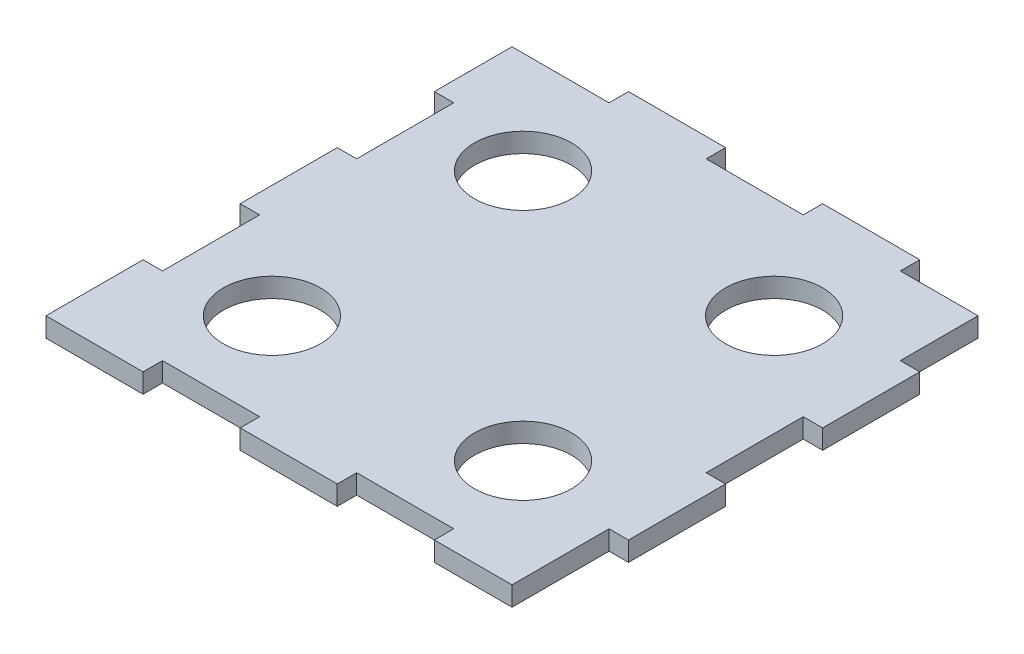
ISO-10303-21;
HEADER;
FILE_DESCRIPTION(('STEP AP214'),'2;1');
FILE_NAME('part.step','',(''),(''),'','','');
FILE_SCHEMA(('AUTOMOTIVE_DESIGN { 1 0 10303 214 1 1 1 1 }'));
ENDSEC;
DATA;
#1=APPLICATION_CONTEXT('core data for automotive mechanical design processes');
#2=APPLICATION_PROTOCOL_DEFINITION('international standard','automotive_design',2000,#1);
#3=PRODUCT_CONTEXT('',#1,'mechanical');
#4=PRODUCT('Part','Part','',(#3));
#5=PRODUCT_RELATED_PRODUCT_CATEGORY('part','',(#4));
#6=PRODUCT_DEFINITION_FORMATION('','',#4);
#7=PRODUCT_DEFINITION_CONTEXT('part definition',#1,'design');
#8=PRODUCT_DEFINITION('design','',#6,#7);
#9=PRODUCT_DEFINITION_SHAPE('','',#8);
#10=(LENGTH_UNIT() NAMED_UNIT(*) SI_UNIT(.MILLI.,.METRE.));
#11=(NAMED_UNIT(*) PLANE_ANGLE_UNIT() SI_UNIT($,.RADIAN.));
#12=(NAMED_UNIT(*) SI_UNIT($,.STERADIAN.) SOLID_ANGLE_UNIT());
#13=UNCERTAINTY_MEASURE_WITH_UNIT(LENGTH_MEASURE(1.E-05),#10,'distance_accuracy_value','');
#14=(GEOMETRIC_REPRESENTATION_CONTEXT(3) GLOBAL_UNCERTAINTY_ASSIGNED_CONTEXT((#13)) GLOBAL_UNIT_ASSIGNED_CONTEXT((#10,
#11,#12)) REPRESENTATION_CONTEXT('',''));
#15=CARTESIAN_POINT('',(0.,0.,0.));
#16=DIRECTION('',(0.,0.,1.));
#17=DIRECTION('',(1.,0.,0.));
#18=AXIS2_PLACEMENT_3D('',#15,#16,#17);
#19=CARTESIAN_POINT('',(0.,4.,0.));
#20=DIRECTION('',(0.,1.,0.));
#21=DIRECTION('',(0.,0.,1.));
#22=AXIS2_PLACEMENT_3D('',#19,#20,#21);
#23=PLANE('',#22);
#24=CARTESIAN_POINT('',(-26.7320869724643,4.,26.7320869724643));
#25=DIRECTION('',(0.,1.,0.));
#26=DIRECTION('',(0.,0.,1.));
#27=AXIS2_PLACEMENT_3D('',#24,#25,#26);
#28=CIRCLE('',#27,10.);
#29=CARTESIAN_POINT('',(-26.7320869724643,4.,36.7320869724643));
#30=VERTEX_POINT('',#29);
#31=EDGE_CURVE('E603',#30,#30,#28,.T.);
#32=ORIENTED_EDGE('',*,*,#31,.F.);
#33=EDGE_LOOP('',(#32));
#34=FACE_BOUND('',#33,.T.);
#35=CARTESIAN_POINT('',(25.,4.,-25.));
#36=DIRECTION('',(0.,1.,0.));
#37=DIRECTION('',(0.,0.,1.));
#38=AXIS2_PLACEMENT_3D('',#35,#36,#37);
#39=CIRCLE('',#38,10.);
#40=CARTESIAN_POINT('',(25.,4.,-15.));
#41=VERTEX_POINT('',#40);
#42=EDGE_CURVE('E302',#41,#41,#39,.T.);
#43=ORIENTED_EDGE('',*,*,#42,.F.);
#44=EDGE_LOOP('',(#43));
#45=FACE_BOUND('',#44,.T.);
#46=DIRECTION('',(0.,0.,-1.));
#47=VECTOR('',#46,1.);
#48=CARTESIAN_POINT('',(46.,4.,30.));
#49=LINE('',#48,#47);
#50=CARTESIAN_POINT('',(46.,4.,50.));
#51=VERTEX_POINT('',#50);
#52=CARTESIAN_POINT('',(46.,4.,30.));
#53=VERTEX_POINT('',#52);
#54=EDGE_CURVE('E369',#51,#53,#49,.T.);
#55=ORIENTED_EDGE('',*,*,#54,.T.);
#56=DIRECTION('',(1.,0.,0.));
#57=VECTOR('',#56,1.);
#58=CARTESIAN_POINT('',(50.,4.,30.));
#59=LINE('',#58,#57);
#60=CARTESIAN_POINT('',(50.,4.,30.));
#61=VERTEX_POINT('',#60);
#62=EDGE_CURVE('E177',#53,#61,#59,.T.);
#63=ORIENTED_EDGE('',*,*,#62,.T.);
#64=DIRECTION('',(0.,0.,-1.));
#65=VECTOR('',#64,1.);
#66=CARTESIAN_POINT('',(50.,4.,9.99999999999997));
#67=LINE('',#66,#65);
#68=CARTESIAN_POINT('',(50.,4.,9.99999999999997));
#69=VERTEX_POINT('',#68);
#70=EDGE_CURVE('E468',#61,#69,#67,.T.);
#71=ORIENTED_EDGE('',*,*,#70,.T.);
#72=DIRECTION('',(-1.,0.,0.));
#73=VECTOR('',#72,1.);
#74=CARTESIAN_POINT('',(46.,4.,9.99999999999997));
#75=LINE('',#74,#73);
#76=CARTESIAN_POINT('',(46.,4.,9.99999999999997));
#77=VERTEX_POINT('',#76);
#78=EDGE_CURVE('E487',#69,#77,#75,.T.);
#79=ORIENTED_EDGE('',*,*,#78,.T.);
#80=DIRECTION('',(0.,0.,-1.));
#81=VECTOR('',#80,1.);
#82=CARTESIAN_POINT('',(46.,4.,-10.));
#83=LINE('',#82,#81);
#84=CARTESIAN_POINT('',(46.,4.,-10.));
#85=VERTEX_POINT('',#84);
#86=EDGE_CURVE('E484',#77,#85,#83,.T.);
#87=ORIENTED_EDGE('',*,*,#86,.T.);
#88=DIRECTION('',(1.,0.,0.));
#89=VECTOR('',#88,1.);
#90=CARTESIAN_POINT('',(50.,4.,-10.));
#91=LINE('',#90,#89);
#92=CARTESIAN_POINT('',(50.,4.,-10.));
#93=VERTEX_POINT('',#92);
#94=EDGE_CURVE('E486',#85,#93,#91,.T.);
#95=ORIENTED_EDGE('',*,*,#94,.T.);
#96=DIRECTION('',(0.,0.,-1.));
#97=VECTOR('',#96,1.);
#98=CARTESIAN_POINT('',(50.,4.,-30.));
#99=LINE('',#98,#97);
#100=CARTESIAN_POINT('',(50.,4.,-30.));
#101=VERTEX_POINT('',#100);
#102=EDGE_CURVE('E489',#93,#101,#99,.T.);
#103=ORIENTED_EDGE('',*,*,#102,.T.);
#104=DIRECTION('',(-1.,0.,0.));
#105=VECTOR('',#104,1.);
#106=CARTESIAN_POINT('',(46.,4.,-30.));
#107=LINE('',#106,#105);
#108=CARTESIAN_POINT('',(46.,4.,-30.));
#109=VERTEX_POINT('',#108);
#110=EDGE_CURVE('E495',#101,#109,#107,.T.);
#111=ORIENTED_EDGE('',*,*,#110,.T.);
#112=DIRECTION('',(0.,0.,-1.));
#113=VECTOR('',#112,1.);
#114=CARTESIAN_POINT('',(46.,4.,-46.));
#115=LINE('',#114,#113);
#116=CARTESIAN_POINT('',(46.,4.,-46.));
#117=VERTEX_POINT('',#116);
#118=EDGE_CURVE('E497',#109,#117,#115,.T.);
#119=ORIENTED_EDGE('',*,*,#118,.T.);
#120=DIRECTION('',(-1.,0.,0.));
#121=VECTOR('',#120,1.);
#122=CARTESIAN_POINT('',(30.,4.,-46.));
#123=LINE('',#122,#121);
#124=CARTESIAN_POINT('',(30.,4.,-46.));
#125=VERTEX_POINT('',#124);
#126=EDGE_CURVE('E499',#117,#125,#123,.T.);
#127=ORIENTED_EDGE('',*,*,#126,.T.);
#128=DIRECTION('',(0.,0.,-1.));
#129=VECTOR('',#128,1.);
#130=CARTESIAN_POINT('',(30.,4.,-50.));
#131=LINE('',#130,#129);
#132=CARTESIAN_POINT('',(30.,4.,-50.));
#133=VERTEX_POINT('',#132);
#134=EDGE_CURVE('E501',#125,#133,#131,.T.);
#135=ORIENTED_EDGE('',*,*,#134,.T.);
#136=DIRECTION('',(-1.,0.,0.));
#137=VECTOR('',#136,1.);
#138=CARTESIAN_POINT('',(9.99999999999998,4.,-50.));
#139=LINE('',#138,#137);
#140=CARTESIAN_POINT('',(9.99999999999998,4.,-50.));
#141=VERTEX_POINT('',#140);
#142=EDGE_CURVE('E503',#133,#141,#139,.T.);
#143=ORIENTED_EDGE('',*,*,#142,.T.);
#144=DIRECTION('',(0.,0.,1.));
#145=VECTOR('',#144,1.);
#146=CARTESIAN_POINT('',(9.99999999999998,4.,-46.0000000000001));
#147=LINE('',#146,#145);
#148=CARTESIAN_POINT('',(9.99999999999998,4.,-46.0000000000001));
#149=VERTEX_POINT('',#148);
#150=EDGE_CURVE('E505',#141,#149,#147,.T.);
#151=ORIENTED_EDGE('',*,*,#150,.T.);
#152=DIRECTION('',(-1.,0.,0.));
#153=VECTOR('',#152,1.);
#154=CARTESIAN_POINT('',(-10.,4.,-46.0000000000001));
#155=LINE('',#154,#153);
#156=CARTESIAN_POINT('',(-10.,4.,-46.0000000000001));
#157=VERTEX_POINT('',#156);
#158=EDGE_CURVE('E507',#149,#157,#155,.T.);
#159=ORIENTED_EDGE('',*,*,#158,.T.);
#160=DIRECTION('',(0.,0.,-1.));
#161=VECTOR('',#160,1.);
#162=CARTESIAN_POINT('',(-10.,4.,-46.0000000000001));
#163=LINE('',#162,#161);
#164=CARTESIAN_POINT('',(-10.,4.,-50.));
#165=VERTEX_POINT('',#164);
#166=EDGE_CURVE('E509',#157,#165,#163,.T.);
#167=ORIENTED_EDGE('',*,*,#166,.T.);
#168=DIRECTION('',(-1.,0.,0.));
#169=VECTOR('',#168,1.);
#170=CARTESIAN_POINT('',(-10.,4.,-50.));
#171=LINE('',#170,#169);
#172=CARTESIAN_POINT('',(-30.,4.,-50.));
#173=VERTEX_POINT('',#172);
#174=EDGE_CURVE('E511',#165,#173,#171,.T.);
#175=ORIENTED_EDGE('',*,*,#174,.T.);
#176=DIRECTION('',(0.,0.,1.));
#177=VECTOR('',#176,1.);
#178=CARTESIAN_POINT('',(-30.,4.,-50.));
#179=LINE('',#178,#177);
#180=CARTESIAN_POINT('',(-30.,4.,-46.));
#181=VERTEX_POINT('',#180);
#182=EDGE_CURVE('E513',#173,#181,#179,.T.);
#183=ORIENTED_EDGE('',*,*,#182,.T.);
#184=DIRECTION('',(-1.,0.,0.));
#185=VECTOR('',#184,1.);
#186=CARTESIAN_POINT('',(-50.,4.,-46.));
#187=LINE('',#186,#185);
#188=CARTESIAN_POINT('',(-50.,4.,-46.));
#189=VERTEX_POINT('',#188);
#190=EDGE_CURVE('E515',#181,#189,#187,.T.);
#191=ORIENTED_EDGE('',*,*,#190,.T.);
#192=DIRECTION('',(0.,0.,1.));
#193=VECTOR('',#192,1.);
#194=CARTESIAN_POINT('',(-50.,4.,-46.));
#195=LINE('',#194,#193);
#196=CARTESIAN_POINT('',(-50.,4.,-30.));
#197=VERTEX_POINT('',#196);
#198=EDGE_CURVE('E517',#189,#197,#195,.T.);
#199=ORIENTED_EDGE('',*,*,#198,.T.);
#200=DIRECTION('',(1.,0.,0.));
#201=VECTOR('',#200,1.);
#202=CARTESIAN_POINT('',(-50.,4.,-30.));
#203=LINE('',#202,#201);
#204=CARTESIAN_POINT('',(-46.,4.,-30.));
#205=VERTEX_POINT('',#204);
#206=EDGE_CURVE('E519',#197,#205,#203,.T.);
#207=ORIENTED_EDGE('',*,*,#206,.T.);
#208=DIRECTION('',(0.,0.,1.));
#209=VECTOR('',#208,1.);
#210=CARTESIAN_POINT('',(-46.,4.,-30.));
#211=LINE('',#210,#209);
#212=CARTESIAN_POINT('',(-46.,4.,-10.));
#213=VERTEX_POINT('',#212);
#214=EDGE_CURVE('E521',#205,#213,#211,.T.);
#215=ORIENTED_EDGE('',*,*,#214,.T.);
#216=DIRECTION('',(-1.,0.,0.));
#217=VECTOR('',#216,1.);
#218=CARTESIAN_POINT('',(-46.,4.,-10.));
#219=LINE('',#218,#217);
#220=CARTESIAN_POINT('',(-50.,4.,-10.));
#221=VERTEX_POINT('',#220);
#222=EDGE_CURVE('E523',#213,#221,#219,.T.);
#223=ORIENTED_EDGE('',*,*,#222,.T.);
#224=DIRECTION('',(0.,0.,1.));
#225=VECTOR('',#224,1.);
#226=CARTESIAN_POINT('',(-50.,4.,-10.));
#227=LINE('',#226,#225);
#228=CARTESIAN_POINT('',(-50.,4.,9.99999999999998));
#229=VERTEX_POINT('',#228);
#230=EDGE_CURVE('E525',#221,#229,#227,.T.);
#231=ORIENTED_EDGE('',*,*,#230,.T.);
#232=DIRECTION('',(1.,0.,0.));
#233=VECTOR('',#232,1.);
#234=CARTESIAN_POINT('',(-50.,4.,9.99999999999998));
#235=LINE('',#234,#233);
#236=CARTESIAN_POINT('',(-46.,4.,9.99999999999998));
#237=VERTEX_POINT('',#236);
#238=EDGE_CURVE('E527',#229,#237,#235,.T.);
#239=ORIENTED_EDGE('',*,*,#238,.T.);
#240=DIRECTION('',(0.,0.,1.));
#241=VECTOR('',#240,1.);
#242=CARTESIAN_POINT('',(-46.,4.,9.99999999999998));
#243=LINE('',#242,#241);
#244=CARTESIAN_POINT('',(-46.,4.,30.));
#245=VERTEX_POINT('',#244);
#246=EDGE_CURVE('E529',#237,#245,#243,.T.);
#247=ORIENTED_EDGE('',*,*,#246,.T.);
#248=DIRECTION('',(-1.,0.,0.));
#249=VECTOR('',#248,1.);
#250=CARTESIAN_POINT('',(-46.,4.,30.));
#251=LINE('',#250,#249);
#252=CARTESIAN_POINT('',(-50.,4.,30.));
#253=VERTEX_POINT('',#252);
#254=EDGE_CURVE('E531',#245,#253,#251,.T.);
#255=ORIENTED_EDGE('',*,*,#254,.T.);
#256=DIRECTION('',(0.,0.,1.));
#257=VECTOR('',#256,1.);
#258=CARTESIAN_POINT('',(-50.,4.,30.));
#259=LINE('',#258,#257);
#260=CARTESIAN_POINT('',(-50.,4.,50.));
#261=VERTEX_POINT('',#260);
#262=EDGE_CURVE('E533',#253,#261,#259,.T.);
#263=ORIENTED_EDGE('',*,*,#262,.T.);
#264=DIRECTION('',(1.,0.,0.));
#265=VECTOR('',#264,1.);
#266=CARTESIAN_POINT('',(-50.,4.,50.));
#267=LINE('',#266,#265);
#268=CARTESIAN_POINT('',(-30.,4.,50.));
#269=VERTEX_POINT('',#268);
#270=EDGE_CURVE('E535',#261,#269,#267,.T.);
#271=ORIENTED_EDGE('',*,*,#270,.T.);
#272=DIRECTION('',(0.,0.,-1.));
#273=VECTOR('',#272,1.);
#274=CARTESIAN_POINT('',(-30.,4.,46.));
#275=LINE('',#274,#273);
#276=CARTESIAN_POINT('',(-30.,4.,46.));
#277=VERTEX_POINT('',#276);
#278=EDGE_CURVE('E537',#269,#277,#275,.T.);
#279=ORIENTED_EDGE('',*,*,#278,.T.);
#280=DIRECTION('',(1.,0.,0.));
#281=VECTOR('',#280,1.);
#282=CARTESIAN_POINT('',(-10.,4.,46.));
#283=LINE('',#282,#281);
#284=CARTESIAN_POINT('',(-10.,4.,46.));
#285=VERTEX_POINT('',#284);
#286=EDGE_CURVE('E539',#277,#285,#283,.T.);
#287=ORIENTED_EDGE('',*,*,#286,.T.);
#288=DIRECTION('',(0.,0.,1.));
#289=VECTOR('',#288,1.);
#290=CARTESIAN_POINT('',(-10.,4.,50.));
#291=LINE('',#290,#289);
#292=CARTESIAN_POINT('',(-10.,4.,50.));
#293=VERTEX_POINT('',#292);
#294=EDGE_CURVE('E541',#285,#293,#291,.T.);
#295=ORIENTED_EDGE('',*,*,#294,.T.);
#296=DIRECTION('',(1.,0.,0.));
#297=VECTOR('',#296,1.);
#298=CARTESIAN_POINT('',(-10.,4.,50.));
#299=LINE('',#298,#297);
#300=CARTESIAN_POINT('',(9.99999999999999,4.,50.));
#301=VERTEX_POINT('',#300);
#302=EDGE_CURVE('E543',#293,#301,#299,.T.);
#303=ORIENTED_EDGE('',*,*,#302,.T.);
#304=DIRECTION('',(0.,0.,-1.));
#305=VECTOR('',#304,1.);
#306=CARTESIAN_POINT('',(9.99999999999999,4.,50.));
#307=LINE('',#306,#305);
#308=CARTESIAN_POINT('',(9.99999999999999,4.,46.));
#309=VERTEX_POINT('',#308);
#310=EDGE_CURVE('E280',#301,#309,#307,.T.);
#311=ORIENTED_EDGE('',*,*,#310,.T.);
#312=DIRECTION('',(1.,0.,0.));
#313=VECTOR('',#312,1.);
#314=CARTESIAN_POINT('',(9.99999999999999,4.,46.));
#315=LINE('',#314,#313);
#316=CARTESIAN_POINT('',(30.,4.,46.));
#317=VERTEX_POINT('',#316);
#318=EDGE_CURVE('E274',#309,#317,#315,.T.);
#319=ORIENTED_EDGE('',*,*,#318,.T.);
#320=DIRECTION('',(0.,0.,1.));
#321=VECTOR('',#320,1.);
#322=CARTESIAN_POINT('',(30.,4.,46.));
#323=LINE('',#322,#321);
#324=CARTESIAN_POINT('',(30.,4.,50.));
#325=VERTEX_POINT('',#324);
#326=EDGE_CURVE('E278',#317,#325,#323,.T.);
#327=ORIENTED_EDGE('',*,*,#326,.T.);
#328=DIRECTION('',(1.,0.,0.));
#329=VECTOR('',#328,1.);
#330=CARTESIAN_POINT('',(30.,4.,50.));
#331=LINE('',#330,#329);
#332=EDGE_CURVE('E50',#325,#51,#331,.T.);
#333=ORIENTED_EDGE('',*,*,#332,.T.);
#334=EDGE_LOOP('',(#55,#63,#71,#79,#87,#95,#103,#111,#119,#127,#135,#143,#151,#159,#167,#175,
#183,#191,#199,#207,#215,#223,#231,#239,#247,#255,#263,#271,#279,#287,#295,#303,#311,#319,#327,#333));
#335=FACE_BOUND('',#334,.T.);
#336=CARTESIAN_POINT('',(25.,4.,26.7320869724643));
#337=DIRECTION('',(0.,1.,0.));
#338=DIRECTION('',(0.,0.,1.));
#339=AXIS2_PLACEMENT_3D('',#336,#337,#338);
#340=CIRCLE('',#339,10.);
#341=CARTESIAN_POINT('',(25.,4.,36.7320869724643));
#342=VERTEX_POINT('',#341);
#343=EDGE_CURVE('E609',#342,#342,#340,.T.);
#344=ORIENTED_EDGE('',*,*,#343,.F.);
#345=EDGE_LOOP('',(#344));
#346=FACE_BOUND('',#345,.T.);
#347=CARTESIAN_POINT('',(-26.7320869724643,4.,-25.));
#348=DIRECTION('',(0.,1.,0.));
#349=DIRECTION('',(0.,0.,1.));
#350=AXIS2_PLACEMENT_3D('',#347,#348,#349);
#351=CIRCLE('',#350,10.);
#352=CARTESIAN_POINT('',(-26.7320869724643,4.,-15.));
#353=VERTEX_POINT('',#352);
#354=EDGE_CURVE('E594',#353,#353,#351,.T.);
#355=ORIENTED_EDGE('',*,*,#354,.F.);
#356=EDGE_LOOP('',(#355));
#357=FACE_BOUND('',#356,.T.);
#358=ADVANCED_FACE('F33',(#34,#45,#335,#346,#357),#23,.T.);
#359=CARTESIAN_POINT('',(0.,0.,0.));
#360=DIRECTION('',(0.,1.,0.));
#361=DIRECTION('',(0.,0.,1.));
#362=AXIS2_PLACEMENT_3D('',#359,#360,#361);
#363=PLANE('',#362);
#364=DIRECTION('',(0.,0.,-1.));
#365=VECTOR('',#364,1.);
#366=CARTESIAN_POINT('',(46.,0.,30.));
#367=LINE('',#366,#365);
#368=CARTESIAN_POINT('',(46.,0.,50.));
#369=VERTEX_POINT('',#368);
#370=CARTESIAN_POINT('',(46.,0.,30.));
#371=VERTEX_POINT('',#370);
#372=EDGE_CURVE('E298',#369,#371,#367,.T.);
#373=ORIENTED_EDGE('',*,*,#372,.F.);
#374=DIRECTION('',(1.,0.,0.));
#375=VECTOR('',#374,1.);
#376=CARTESIAN_POINT('',(30.,0.,50.));
#377=LINE('',#376,#375);
#378=CARTESIAN_POINT('',(30.,0.,50.));
#379=VERTEX_POINT('',#378);
#380=EDGE_CURVE('E169',#379,#369,#377,.T.);
#381=ORIENTED_EDGE('',*,*,#380,.F.);
#382=DIRECTION('',(0.,0.,1.));
#383=VECTOR('',#382,1.);
#384=CARTESIAN_POINT('',(30.,0.,46.));
#385=LINE('',#384,#383);
#386=CARTESIAN_POINT('',(30.,0.,46.));
#387=VERTEX_POINT('',#386);
#388=EDGE_CURVE('E163',#387,#379,#385,.T.);
#389=ORIENTED_EDGE('',*,*,#388,.F.);
#390=DIRECTION('',(1.,0.,0.));
#391=VECTOR('',#390,1.);
#392=CARTESIAN_POINT('',(9.99999999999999,0.,46.));
#393=LINE('',#392,#391);
#394=CARTESIAN_POINT('',(9.99999999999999,0.,46.));
#395=VERTEX_POINT('',#394);
#396=EDGE_CURVE('E288',#395,#387,#393,.T.);
#397=ORIENTED_EDGE('',*,*,#396,.F.);
#398=DIRECTION('',(0.,0.,-1.));
#399=VECTOR('',#398,1.);
#400=CARTESIAN_POINT('',(9.99999999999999,0.,50.));
#401=LINE('',#400,#399);
#402=CARTESIAN_POINT('',(9.99999999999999,0.,50.));
#403=VERTEX_POINT('',#402);
#404=EDGE_CURVE('E364',#403,#395,#401,.T.);
#405=ORIENTED_EDGE('',*,*,#404,.F.);
#406=DIRECTION('',(1.,0.,0.));
#407=VECTOR('',#406,1.);
#408=CARTESIAN_POINT('',(-10.,0.,50.));
#409=LINE('',#408,#407);
#410=CARTESIAN_POINT('',(-10.,0.,50.));
#411=VERTEX_POINT('',#410);
#412=EDGE_CURVE('E362',#411,#403,#409,.T.);
#413=ORIENTED_EDGE('',*,*,#412,.F.);
#414=DIRECTION('',(0.,0.,1.));
#415=VECTOR('',#414,1.);
#416=CARTESIAN_POINT('',(-10.,0.,50.));
#417=LINE('',#416,#415);
#418=CARTESIAN_POINT('',(-10.,0.,46.));
#419=VERTEX_POINT('',#418);
#420=EDGE_CURVE('E360',#419,#411,#417,.T.);
#421=ORIENTED_EDGE('',*,*,#420,.F.);
#422=DIRECTION('',(1.,0.,0.));
#423=VECTOR('',#422,1.);
#424=CARTESIAN_POINT('',(-10.,0.,46.));
#425=LINE('',#424,#423);
#426=CARTESIAN_POINT('',(-30.,0.,46.));
#427=VERTEX_POINT('',#426);
#428=EDGE_CURVE('E358',#427,#419,#425,.T.);
#429=ORIENTED_EDGE('',*,*,#428,.F.);
#430=DIRECTION('',(0.,0.,-1.));
#431=VECTOR('',#430,1.);
#432=CARTESIAN_POINT('',(-30.,0.,46.));
#433=LINE('',#432,#431);
#434=CARTESIAN_POINT('',(-30.,0.,50.));
#435=VERTEX_POINT('',#434);
#436=EDGE_CURVE('E356',#435,#427,#433,.T.);
#437=ORIENTED_EDGE('',*,*,#436,.F.);
#438=DIRECTION('',(1.,0.,0.));
#439=VECTOR('',#438,1.);
#440=CARTESIAN_POINT('',(-50.,0.,50.));
#441=LINE('',#440,#439);
#442=CARTESIAN_POINT('',(-50.,0.,50.));
#443=VERTEX_POINT('',#442);
#444=EDGE_CURVE('E354',#443,#435,#441,.T.);
#445=ORIENTED_EDGE('',*,*,#444,.F.);
#446=DIRECTION('',(0.,0.,1.));
#447=VECTOR('',#446,1.);
#448=CARTESIAN_POINT('',(-50.,0.,30.));
#449=LINE('',#448,#447);
#450=CARTESIAN_POINT('',(-50.,0.,30.));
#451=VERTEX_POINT('',#450);
#452=EDGE_CURVE('E352',#451,#443,#449,.T.);
#453=ORIENTED_EDGE('',*,*,#452,.F.);
#454=DIRECTION('',(-1.,0.,0.));
#455=VECTOR('',#454,1.);
#456=CARTESIAN_POINT('',(-46.,0.,30.));
#457=LINE('',#456,#455);
#458=CARTESIAN_POINT('',(-46.,0.,30.));
#459=VERTEX_POINT('',#458);
#460=EDGE_CURVE('E350',#459,#451,#457,.T.);
#461=ORIENTED_EDGE('',*,*,#460,.F.);
#462=DIRECTION('',(0.,0.,1.));
#463=VECTOR('',#462,1.);
#464=CARTESIAN_POINT('',(-46.,0.,9.99999999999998));
#465=LINE('',#464,#463);
#466=CARTESIAN_POINT('',(-46.,0.,9.99999999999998));
#467=VERTEX_POINT('',#466);
#468=EDGE_CURVE('E348',#467,#459,#465,.T.);
#469=ORIENTED_EDGE('',*,*,#468,.F.);
#470=DIRECTION('',(1.,0.,0.));
#471=VECTOR('',#470,1.);
#472=CARTESIAN_POINT('',(-50.,0.,9.99999999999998));
#473=LINE('',#472,#471);
#474=CARTESIAN_POINT('',(-50.,0.,9.99999999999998));
#475=VERTEX_POINT('',#474);
#476=EDGE_CURVE('E346',#475,#467,#473,.T.);
#477=ORIENTED_EDGE('',*,*,#476,.F.);
#478=DIRECTION('',(0.,0.,1.));
#479=VECTOR('',#478,1.);
#480=CARTESIAN_POINT('',(-50.,0.,-10.));
#481=LINE('',#480,#479);
#482=CARTESIAN_POINT('',(-50.,0.,-10.));
#483=VERTEX_POINT('',#482);
#484=EDGE_CURVE('E344',#483,#475,#481,.T.);
#485=ORIENTED_EDGE('',*,*,#484,.F.);
#486=DIRECTION('',(-1.,0.,0.));
#487=VECTOR('',#486,1.);
#488=CARTESIAN_POINT('',(-46.,0.,-10.));
#489=LINE('',#488,#487);
#490=CARTESIAN_POINT('',(-46.,0.,-10.));
#491=VERTEX_POINT('',#490);
#492=EDGE_CURVE('E342',#491,#483,#489,.T.);
#493=ORIENTED_EDGE('',*,*,#492,.F.);
#494=DIRECTION('',(0.,0.,1.));
#495=VECTOR('',#494,1.);
#496=CARTESIAN_POINT('',(-46.,0.,-30.));
#497=LINE('',#496,#495);
#498=CARTESIAN_POINT('',(-46.,0.,-30.));
#499=VERTEX_POINT('',#498);
#500=EDGE_CURVE('E340',#499,#491,#497,.T.);
#501=ORIENTED_EDGE('',*,*,#500,.F.);
#502=DIRECTION('',(1.,0.,0.));
#503=VECTOR('',#502,1.);
#504=CARTESIAN_POINT('',(-50.,0.,-30.));
#505=LINE('',#504,#503);
#506=CARTESIAN_POINT('',(-50.,0.,-30.));
#507=VERTEX_POINT('',#506);
#508=EDGE_CURVE('E338',#507,#499,#505,.T.);
#509=ORIENTED_EDGE('',*,*,#508,.F.);
#510=DIRECTION('',(0.,0.,1.));
#511=VECTOR('',#510,1.);
#512=CARTESIAN_POINT('',(-50.,0.,-46.));
#513=LINE('',#512,#511);
#514=CARTESIAN_POINT('',(-50.,0.,-46.));
#515=VERTEX_POINT('',#514);
#516=EDGE_CURVE('E336',#515,#507,#513,.T.);
#517=ORIENTED_EDGE('',*,*,#516,.F.);
#518=DIRECTION('',(-1.,0.,0.));
#519=VECTOR('',#518,1.);
#520=CARTESIAN_POINT('',(-50.,0.,-46.));
#521=LINE('',#520,#519);
#522=CARTESIAN_POINT('',(-30.,0.,-46.));
#523=VERTEX_POINT('',#522);
#524=EDGE_CURVE('E334',#523,#515,#521,.T.);
#525=ORIENTED_EDGE('',*,*,#524,.F.);
#526=DIRECTION('',(0.,0.,1.));
#527=VECTOR('',#526,1.);
#528=CARTESIAN_POINT('',(-30.,0.,-50.));
#529=LINE('',#528,#527);
#530=CARTESIAN_POINT('',(-30.,0.,-50.));
#531=VERTEX_POINT('',#530);
#532=EDGE_CURVE('E332',#531,#523,#529,.T.);
#533=ORIENTED_EDGE('',*,*,#532,.F.);
#534=DIRECTION('',(-1.,0.,0.));
#535=VECTOR('',#534,1.);
#536=CARTESIAN_POINT('',(-10.,0.,-50.));
#537=LINE('',#536,#535);
#538=CARTESIAN_POINT('',(-10.,0.,-50.));
#539=VERTEX_POINT('',#538);
#540=EDGE_CURVE('E330',#539,#531,#537,.T.);
#541=ORIENTED_EDGE('',*,*,#540,.F.);
#542=DIRECTION('',(0.,0.,-1.));
#543=VECTOR('',#542,1.);
#544=CARTESIAN_POINT('',(-10.,0.,-46.0000000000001));
#545=LINE('',#544,#543);
#546=CARTESIAN_POINT('',(-10.,0.,-46.0000000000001));
#547=VERTEX_POINT('',#546);
#548=EDGE_CURVE('E328',#547,#539,#545,.T.);
#549=ORIENTED_EDGE('',*,*,#548,.F.);
#550=DIRECTION('',(-1.,0.,0.));
#551=VECTOR('',#550,1.);
#552=CARTESIAN_POINT('',(-10.,0.,-46.0000000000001));
#553=LINE('',#552,#551);
#554=CARTESIAN_POINT('',(9.99999999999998,0.,-46.0000000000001));
#555=VERTEX_POINT('',#554);
#556=EDGE_CURVE('E326',#555,#547,#553,.T.);
#557=ORIENTED_EDGE('',*,*,#556,.F.);
#558=DIRECTION('',(0.,0.,1.));
#559=VECTOR('',#558,1.);
#560=CARTESIAN_POINT('',(9.99999999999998,0.,-46.0000000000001));
#561=LINE('',#560,#559);
#562=CARTESIAN_POINT('',(9.99999999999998,0.,-50.));
#563=VERTEX_POINT('',#562);
#564=EDGE_CURVE('E324',#563,#555,#561,.T.);
#565=ORIENTED_EDGE('',*,*,#564,.F.);
#566=DIRECTION('',(-1.,0.,0.));
#567=VECTOR('',#566,1.);
#568=CARTESIAN_POINT('',(9.99999999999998,0.,-50.));
#569=LINE('',#568,#567);
#570=CARTESIAN_POINT('',(30.,0.,-50.));
#571=VERTEX_POINT('',#570);
#572=EDGE_CURVE('E322',#571,#563,#569,.T.);
#573=ORIENTED_EDGE('',*,*,#572,.F.);
#574=DIRECTION('',(0.,0.,-1.));
#575=VECTOR('',#574,1.);
#576=CARTESIAN_POINT('',(30.,0.,-50.));
#577=LINE('',#576,#575);
#578=CARTESIAN_POINT('',(30.,0.,-46.));
#579=VERTEX_POINT('',#578);
#580=EDGE_CURVE('E320',#579,#571,#577,.T.);
#581=ORIENTED_EDGE('',*,*,#580,.F.);
#582=DIRECTION('',(-1.,0.,0.));
#583=VECTOR('',#582,1.);
#584=CARTESIAN_POINT('',(30.,0.,-46.));
#585=LINE('',#584,#583);
#586=CARTESIAN_POINT('',(46.,0.,-46.));
#587=VERTEX_POINT('',#586);
#588=EDGE_CURVE('E318',#587,#579,#585,.T.);
#589=ORIENTED_EDGE('',*,*,#588,.F.);
#590=DIRECTION('',(0.,0.,-1.));
#591=VECTOR('',#590,1.);
#592=CARTESIAN_POINT('',(46.,0.,-46.));
#593=LINE('',#592,#591);
#594=CARTESIAN_POINT('',(46.,0.,-30.));
#595=VERTEX_POINT('',#594);
#596=EDGE_CURVE('E316',#595,#587,#593,.T.);
#597=ORIENTED_EDGE('',*,*,#596,.F.);
#598=DIRECTION('',(-1.,0.,0.));
#599=VECTOR('',#598,1.);
#600=CARTESIAN_POINT('',(46.,0.,-30.));
#601=LINE('',#600,#599);
#602=CARTESIAN_POINT('',(50.,0.,-30.));
#603=VERTEX_POINT('',#602);
#604=EDGE_CURVE('E314',#603,#595,#601,.T.);
#605=ORIENTED_EDGE('',*,*,#604,.F.);
#606=DIRECTION('',(0.,0.,-1.));
#607=VECTOR('',#606,1.);
#608=CARTESIAN_POINT('',(50.,0.,-30.));
#609=LINE('',#608,#607);
#610=CARTESIAN_POINT('',(50.,0.,-10.));
#611=VERTEX_POINT('',#610);
#612=EDGE_CURVE('E312',#611,#603,#609,.T.);
#613=ORIENTED_EDGE('',*,*,#612,.F.);
#614=DIRECTION('',(1.,0.,0.));
#615=VECTOR('',#614,1.);
#616=CARTESIAN_POINT('',(50.,0.,-10.));
#617=LINE('',#616,#615);
#618=CARTESIAN_POINT('',(46.,0.,-10.));
#619=VERTEX_POINT('',#618);
#620=EDGE_CURVE('E310',#619,#611,#617,.T.);
#621=ORIENTED_EDGE('',*,*,#620,.F.);
#622=DIRECTION('',(0.,0.,-1.));
#623=VECTOR('',#622,1.);
#624=CARTESIAN_POINT('',(46.,0.,-10.));
#625=LINE('',#624,#623);
#626=CARTESIAN_POINT('',(46.,0.,9.99999999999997));
#627=VERTEX_POINT('',#626);
#628=EDGE_CURVE('E308',#627,#619,#625,.T.);
#629=ORIENTED_EDGE('',*,*,#628,.F.);
#630=DIRECTION('',(-1.,0.,0.));
#631=VECTOR('',#630,1.);
#632=CARTESIAN_POINT('',(46.,0.,9.99999999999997));
#633=LINE('',#632,#631);
#634=CARTESIAN_POINT('',(50.,0.,9.99999999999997));
#635=VERTEX_POINT('',#634);
#636=EDGE_CURVE('E306',#635,#627,#633,.T.);
#637=ORIENTED_EDGE('',*,*,#636,.F.);
#638=DIRECTION('',(0.,0.,-1.));
#639=VECTOR('',#638,1.);
#640=CARTESIAN_POINT('',(50.,0.,9.99999999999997));
#641=LINE('',#640,#639);
#642=CARTESIAN_POINT('',(50.,0.,30.));
#643=VERTEX_POINT('',#642);
#644=EDGE_CURVE('E304',#643,#635,#641,.T.);
#645=ORIENTED_EDGE('',*,*,#644,.F.);
#646=DIRECTION('',(1.,0.,0.));
#647=VECTOR('',#646,1.);
#648=CARTESIAN_POINT('',(50.,0.,30.));
#649=LINE('',#648,#647);
#650=EDGE_CURVE('E301',#371,#643,#649,.T.);
#651=ORIENTED_EDGE('',*,*,#650,.F.);
#652=EDGE_LOOP('',(#373,#381,#389,#397,#405,#413,#421,#429,#437,#445,#453,#461,#469,#477,#485,
#493,#501,#509,#517,#525,#533,#541,#549,#557,#565,#573,#581,#589,#597,#605,#613,#621,#629,#637,
#645,#651));
#653=FACE_BOUND('',#652,.T.);
#654=CARTESIAN_POINT('',(25.,0.,-25.));
#655=DIRECTION('',(0.,1.,0.));
#656=DIRECTION('',(0.,0.,1.));
#657=AXIS2_PLACEMENT_3D('',#654,#655,#656);
#658=CIRCLE('',#657,10.);
#659=CARTESIAN_POINT('',(25.,0.,-15.));
#660=VERTEX_POINT('',#659);
#661=EDGE_CURVE('E612',#660,#660,#658,.T.);
#662=ORIENTED_EDGE('',*,*,#661,.T.);
#663=EDGE_LOOP('',(#662));
#664=FACE_BOUND('',#663,.T.);
#665=CARTESIAN_POINT('',(25.,0.,26.7320869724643));
#666=DIRECTION('',(0.,1.,0.));
#667=DIRECTION('',(0.,0.,1.));
#668=AXIS2_PLACEMENT_3D('',#665,#666,#667);
#669=CIRCLE('',#668,10.);
#670=CARTESIAN_POINT('',(25.,0.,36.7320869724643));
#671=VERTEX_POINT('',#670);
#672=EDGE_CURVE('E606',#671,#671,#669,.T.);
#673=ORIENTED_EDGE('',*,*,#672,.T.);
#674=EDGE_LOOP('',(#673));
#675=FACE_BOUND('',#674,.T.);
#676=CARTESIAN_POINT('',(-26.7320869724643,0.,26.7320869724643));
#677=DIRECTION('',(0.,1.,0.));
#678=DIRECTION('',(0.,0.,1.));
#679=AXIS2_PLACEMENT_3D('',#676,#677,#678);
#680=CIRCLE('',#679,10.);
#681=CARTESIAN_POINT('',(-26.7320869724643,0.,36.7320869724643));
#682=VERTEX_POINT('',#681);
#683=EDGE_CURVE('E600',#682,#682,#680,.T.);
#684=ORIENTED_EDGE('',*,*,#683,.T.);
#685=EDGE_LOOP('',(#684));
#686=FACE_BOUND('',#685,.T.);
#687=CARTESIAN_POINT('',(-26.7320869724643,0.,-25.));
#688=DIRECTION('',(0.,1.,0.));
#689=DIRECTION('',(0.,0.,1.));
#690=AXIS2_PLACEMENT_3D('',#687,#688,#689);
#691=CIRCLE('',#690,10.);
#692=CARTESIAN_POINT('',(-26.7320869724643,0.,-15.));
#693=VERTEX_POINT('',#692);
#694=EDGE_CURVE('E597',#693,#693,#691,.T.);
#695=ORIENTED_EDGE('',*,*,#694,.T.);
#696=EDGE_LOOP('',(#695));
#697=FACE_BOUND('',#696,.T.);
#698=ADVANCED_FACE('F472',(#653,#664,#675,#686,#697),#363,.F.);
#699=CARTESIAN_POINT('',(46.,4.,30.));
#700=DIRECTION('',(-1.,0.,0.));
#701=DIRECTION('',(0.,0.,1.));
#702=AXIS2_PLACEMENT_3D('',#699,#700,#701);
#703=PLANE('',#702);
#704=ORIENTED_EDGE('',*,*,#372,.T.);
#705=DIRECTION('',(0.,-1.,0.));
#706=VECTOR('',#705,1.);
#707=CARTESIAN_POINT('',(46.,4.,30.));
#708=LINE('',#707,#706);
#709=EDGE_CURVE('E11',#53,#371,#708,.T.);
#710=ORIENTED_EDGE('',*,*,#709,.F.);
#711=ORIENTED_EDGE('',*,*,#54,.F.);
#712=DIRECTION('',(0.,-1.,0.));
#713=VECTOR('',#712,1.);
#714=CARTESIAN_POINT('',(46.,4.,50.));
#715=LINE('',#714,#713);
#716=EDGE_CURVE('E294',#51,#369,#715,.T.);
#717=ORIENTED_EDGE('',*,*,#716,.T.);
#718=EDGE_LOOP('',(#704,#710,#711,#717));
#719=FACE_BOUND('',#718,.T.);
#720=ADVANCED_FACE('F35',(#719),#703,.F.);
#721=CARTESIAN_POINT('',(50.,4.,30.));
#722=DIRECTION('',(0.,0.,-1.));
#723=DIRECTION('',(-1.,0.,0.));
#724=AXIS2_PLACEMENT_3D('',#721,#722,#723);
#725=PLANE('',#724);
#726=ORIENTED_EDGE('',*,*,#650,.T.);
#727=DIRECTION('',(0.,-1.,0.));
#728=VECTOR('',#727,1.);
#729=CARTESIAN_POINT('',(50.,4.,30.));
#730=LINE('',#729,#728);
#731=EDGE_CURVE('E42',#61,#643,#730,.T.);
#732=ORIENTED_EDGE('',*,*,#731,.F.);
#733=ORIENTED_EDGE('',*,*,#62,.F.);
#734=ORIENTED_EDGE('',*,*,#709,.T.);
#735=EDGE_LOOP('',(#726,#732,#733,#734));
#736=FACE_BOUND('',#735,.T.);
#737=ADVANCED_FACE('F962',(#736),#725,.F.);
#738=CARTESIAN_POINT('',(50.,4.,9.99999999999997));
#739=DIRECTION('',(-1.,0.,0.));
#740=DIRECTION('',(0.,0.,1.));
#741=AXIS2_PLACEMENT_3D('',#738,#739,#740);
#742=PLANE('',#741);
#743=ORIENTED_EDGE('',*,*,#644,.T.);
#744=DIRECTION('',(0.,-1.,0.));
#745=VECTOR('',#744,1.);
#746=CARTESIAN_POINT('',(50.,4.,9.99999999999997));
#747=LINE('',#746,#745);
#748=EDGE_CURVE('E460',#69,#635,#747,.T.);
#749=ORIENTED_EDGE('',*,*,#748,.F.);
#750=ORIENTED_EDGE('',*,*,#70,.F.);
#751=ORIENTED_EDGE('',*,*,#731,.T.);
#752=EDGE_LOOP('',(#743,#749,#750,#751));
#753=FACE_BOUND('',#752,.T.);
#754=ADVANCED_FACE('F466',(#753),#742,.F.);
#755=CARTESIAN_POINT('',(46.,4.,9.99999999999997));
#756=DIRECTION('',(0.,0.,1.));
#757=DIRECTION('',(1.,0.,0.));
#758=AXIS2_PLACEMENT_3D('',#755,#756,#757);
#759=PLANE('',#758);
#760=ORIENTED_EDGE('',*,*,#636,.T.);
#761=DIRECTION('',(0.,-1.,0.));
#762=VECTOR('',#761,1.);
#763=CARTESIAN_POINT('',(46.,4.,9.99999999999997));
#764=LINE('',#763,#762);
#765=EDGE_CURVE('E457',#77,#627,#764,.T.);
#766=ORIENTED_EDGE('',*,*,#765,.F.);
#767=ORIENTED_EDGE('',*,*,#78,.F.);
#768=ORIENTED_EDGE('',*,*,#748,.T.);
#769=EDGE_LOOP('',(#760,#766,#767,#768));
#770=FACE_BOUND('',#769,.T.);
#771=ADVANCED_FACE('F478',(#770),#759,.F.);
#772=CARTESIAN_POINT('',(46.,4.,-10.));
#773=DIRECTION('',(-1.,0.,0.));
#774=DIRECTION('',(0.,0.,1.));
#775=AXIS2_PLACEMENT_3D('',#772,#773,#774);
#776=PLANE('',#775);
#777=ORIENTED_EDGE('',*,*,#628,.T.);
#778=DIRECTION('',(0.,-1.,0.));
#779=VECTOR('',#778,1.);
#780=CARTESIAN_POINT('',(46.,4.,-10.));
#781=LINE('',#780,#779);
#782=EDGE_CURVE('E454',#85,#619,#781,.T.);
#783=ORIENTED_EDGE('',*,*,#782,.F.);
#784=ORIENTED_EDGE('',*,*,#86,.F.);
#785=ORIENTED_EDGE('',*,*,#765,.T.);
#786=EDGE_LOOP('',(#777,#783,#784,#785));
#787=FACE_BOUND('',#786,.T.);
#788=ADVANCED_FACE('F482',(#787),#776,.F.);
#789=CARTESIAN_POINT('',(50.,4.,-10.));
#790=DIRECTION('',(0.,0.,-1.));
#791=DIRECTION('',(-1.,0.,0.));
#792=AXIS2_PLACEMENT_3D('',#789,#790,#791);
#793=PLANE('',#792);
#794=ORIENTED_EDGE('',*,*,#620,.T.);
#795=DIRECTION('',(0.,-1.,0.));
#796=VECTOR('',#795,1.);
#797=CARTESIAN_POINT('',(50.,4.,-10.));
#798=LINE('',#797,#796);
#799=EDGE_CURVE('E451',#93,#611,#798,.T.);
#800=ORIENTED_EDGE('',*,*,#799,.F.);
#801=ORIENTED_EDGE('',*,*,#94,.F.);
#802=ORIENTED_EDGE('',*,*,#782,.T.);
#803=EDGE_LOOP('',(#794,#800,#801,#802));
#804=FACE_BOUND('',#803,.T.);
#805=ADVANCED_FACE('F927',(#804),#793,.F.);
#806=CARTESIAN_POINT('',(50.,4.,-30.));
#807=DIRECTION('',(-1.,0.,0.));
#808=DIRECTION('',(0.,0.,1.));
#809=AXIS2_PLACEMENT_3D('',#806,#807,#808);
#810=PLANE('',#809);
#811=ORIENTED_EDGE('',*,*,#612,.T.);
#812=DIRECTION('',(0.,-1.,0.));
#813=VECTOR('',#812,1.);
#814=CARTESIAN_POINT('',(50.,4.,-30.));
#815=LINE('',#814,#813);
#816=EDGE_CURVE('E448',#101,#603,#815,.T.);
#817=ORIENTED_EDGE('',*,*,#816,.F.);
#818=ORIENTED_EDGE('',*,*,#102,.F.);
#819=ORIENTED_EDGE('',*,*,#799,.T.);
#820=EDGE_LOOP('',(#811,#817,#818,#819));
#821=FACE_BOUND('',#820,.T.);
#822=ADVANCED_FACE('F917',(#821),#810,.F.);
#823=CARTESIAN_POINT('',(46.,4.,-30.));
#824=DIRECTION('',(0.,0.,1.));
#825=DIRECTION('',(1.,0.,0.));
#826=AXIS2_PLACEMENT_3D('',#823,#824,#825);
#827=PLANE('',#826);
#828=ORIENTED_EDGE('',*,*,#604,.T.);
#829=DIRECTION('',(0.,-1.,0.));
#830=VECTOR('',#829,1.);
#831=CARTESIAN_POINT('',(46.,4.,-30.));
#832=LINE('',#831,#830);
#833=EDGE_CURVE('E445',#109,#595,#832,.T.);
#834=ORIENTED_EDGE('',*,*,#833,.F.);
#835=ORIENTED_EDGE('',*,*,#110,.F.);
#836=ORIENTED_EDGE('',*,*,#816,.T.);
#837=EDGE_LOOP('',(#828,#834,#835,#836));
#838=FACE_BOUND('',#837,.T.);
#839=ADVANCED_FACE('F907',(#838),#827,.F.);
#840=CARTESIAN_POINT('',(46.,4.,-46.));
#841=DIRECTION('',(-1.,0.,0.));
#842=DIRECTION('',(0.,0.,1.));
#843=AXIS2_PLACEMENT_3D('',#840,#841,#842);
#844=PLANE('',#843);
#845=ORIENTED_EDGE('',*,*,#596,.T.);
#846=DIRECTION('',(0.,-1.,0.));
#847=VECTOR('',#846,1.);
#848=CARTESIAN_POINT('',(46.,4.,-46.));
#849=LINE('',#848,#847);
#850=EDGE_CURVE('E442',#117,#587,#849,.T.);
#851=ORIENTED_EDGE('',*,*,#850,.F.);
#852=ORIENTED_EDGE('',*,*,#118,.F.);
#853=ORIENTED_EDGE('',*,*,#833,.T.);
#854=EDGE_LOOP('',(#845,#851,#852,#853));
#855=FACE_BOUND('',#854,.T.);
#856=ADVANCED_FACE('F897',(#855),#844,.F.);
#857=CARTESIAN_POINT('',(30.,4.,-46.));
#858=DIRECTION('',(0.,0.,1.));
#859=DIRECTION('',(1.,0.,0.));
#860=AXIS2_PLACEMENT_3D('',#857,#858,#859);
#861=PLANE('',#860);
#862=ORIENTED_EDGE('',*,*,#588,.T.);
#863=DIRECTION('',(0.,-1.,0.));
#864=VECTOR('',#863,1.);
#865=CARTESIAN_POINT('',(30.,4.,-46.));
#866=LINE('',#865,#864);
#867=EDGE_CURVE('E439',#125,#579,#866,.T.);
#868=ORIENTED_EDGE('',*,*,#867,.F.);
#869=ORIENTED_EDGE('',*,*,#126,.F.);
#870=ORIENTED_EDGE('',*,*,#850,.T.);
#871=EDGE_LOOP('',(#862,#868,#869,#870));
#872=FACE_BOUND('',#871,.T.);
#873=ADVANCED_FACE('F887',(#872),#861,.F.);
#874=CARTESIAN_POINT('',(30.,4.,-50.));
#875=DIRECTION('',(-1.,0.,0.));
#876=DIRECTION('',(0.,0.,1.));
#877=AXIS2_PLACEMENT_3D('',#874,#875,#876);
#878=PLANE('',#877);
#879=ORIENTED_EDGE('',*,*,#580,.T.);
#880=DIRECTION('',(0.,-1.,0.));
#881=VECTOR('',#880,1.);
#882=CARTESIAN_POINT('',(30.,4.,-50.));
#883=LINE('',#882,#881);
#884=EDGE_CURVE('E436',#133,#571,#883,.T.);
#885=ORIENTED_EDGE('',*,*,#884,.F.);
#886=ORIENTED_EDGE('',*,*,#134,.F.);
#887=ORIENTED_EDGE('',*,*,#867,.T.);
#888=EDGE_LOOP('',(#879,#885,#886,#887));
#889=FACE_BOUND('',#888,.T.);
#890=ADVANCED_FACE('F877',(#889),#878,.F.);
#891=CARTESIAN_POINT('',(9.99999999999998,4.,-50.));
#892=DIRECTION('',(0.,0.,1.));
#893=DIRECTION('',(1.,0.,0.));
#894=AXIS2_PLACEMENT_3D('',#891,#892,#893);
#895=PLANE('',#894);
#896=ORIENTED_EDGE('',*,*,#572,.T.);
#897=DIRECTION('',(0.,-1.,0.));
#898=VECTOR('',#897,1.);
#899=CARTESIAN_POINT('',(9.99999999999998,4.,-50.));
#900=LINE('',#899,#898);
#901=EDGE_CURVE('E433',#141,#563,#900,.T.);
#902=ORIENTED_EDGE('',*,*,#901,.F.);
#903=ORIENTED_EDGE('',*,*,#142,.F.);
#904=ORIENTED_EDGE('',*,*,#884,.T.);
#905=EDGE_LOOP('',(#896,#902,#903,#904));
#906=FACE_BOUND('',#905,.T.);
#907=ADVANCED_FACE('F867',(#906),#895,.F.);
#908=CARTESIAN_POINT('',(9.99999999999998,4.,-46.0000000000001));
#909=DIRECTION('',(1.,0.,0.));
#910=DIRECTION('',(0.,0.,-1.));
#911=AXIS2_PLACEMENT_3D('',#908,#909,#910);
#912=PLANE('',#911);
#913=ORIENTED_EDGE('',*,*,#564,.T.);
#914=DIRECTION('',(0.,-1.,0.));
#915=VECTOR('',#914,1.);
#916=CARTESIAN_POINT('',(9.99999999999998,4.,-46.0000000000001));
#917=LINE('',#916,#915);
#918=EDGE_CURVE('E430',#149,#555,#917,.T.);
#919=ORIENTED_EDGE('',*,*,#918,.F.);
#920=ORIENTED_EDGE('',*,*,#150,.F.);
#921=ORIENTED_EDGE('',*,*,#901,.T.);
#922=EDGE_LOOP('',(#913,#919,#920,#921));
#923=FACE_BOUND('',#922,.T.);
#924=ADVANCED_FACE('F857',(#923),#912,.F.);
#925=CARTESIAN_POINT('',(-10.,4.,-46.0000000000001));
#926=DIRECTION('',(0.,0.,1.));
#927=DIRECTION('',(1.,0.,0.));
#928=AXIS2_PLACEMENT_3D('',#925,#926,#927);
#929=PLANE('',#928);
#930=ORIENTED_EDGE('',*,*,#556,.T.);
#931=DIRECTION('',(0.,-1.,0.));
#932=VECTOR('',#931,1.);
#933=CARTESIAN_POINT('',(-10.,4.,-46.0000000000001));
#934=LINE('',#933,#932);
#935=EDGE_CURVE('E427',#157,#547,#934,.T.);
#936=ORIENTED_EDGE('',*,*,#935,.F.);
#937=ORIENTED_EDGE('',*,*,#158,.F.);
#938=ORIENTED_EDGE('',*,*,#918,.T.);
#939=EDGE_LOOP('',(#930,#936,#937,#938));
#940=FACE_BOUND('',#939,.T.);
#941=ADVANCED_FACE('F847',(#940),#929,.F.);
#942=CARTESIAN_POINT('',(-10.,4.,-46.0000000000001));
#943=DIRECTION('',(-1.,0.,0.));
#944=DIRECTION('',(0.,0.,1.));
#945=AXIS2_PLACEMENT_3D('',#942,#943,#944);
#946=PLANE('',#945);
#947=ORIENTED_EDGE('',*,*,#548,.T.);
#948=DIRECTION('',(0.,-1.,0.));
#949=VECTOR('',#948,1.);
#950=CARTESIAN_POINT('',(-10.,4.,-50.));
#951=LINE('',#950,#949);
#952=EDGE_CURVE('E424',#165,#539,#951,.T.);
#953=ORIENTED_EDGE('',*,*,#952,.F.);
#954=ORIENTED_EDGE('',*,*,#166,.F.);
#955=ORIENTED_EDGE('',*,*,#935,.T.);
#956=EDGE_LOOP('',(#947,#953,#954,#955));
#957=FACE_BOUND('',#956,.T.);
#958=ADVANCED_FACE('F837',(#957),#946,.F.);
#959=CARTESIAN_POINT('',(-10.,4.,-50.));
#960=DIRECTION('',(0.,0.,1.));
#961=DIRECTION('',(1.,0.,0.));
#962=AXIS2_PLACEMENT_3D('',#959,#960,#961);
#963=PLANE('',#962);
#964=ORIENTED_EDGE('',*,*,#540,.T.);
#965=DIRECTION('',(0.,-1.,0.));
#966=VECTOR('',#965,1.);
#967=CARTESIAN_POINT('',(-30.,4.,-50.));
#968=LINE('',#967,#966);
#969=EDGE_CURVE('E421',#173,#531,#968,.T.);
#970=ORIENTED_EDGE('',*,*,#969,.F.);
#971=ORIENTED_EDGE('',*,*,#174,.F.);
#972=ORIENTED_EDGE('',*,*,#952,.T.);
#973=EDGE_LOOP('',(#964,#970,#971,#972));
#974=FACE_BOUND('',#973,.T.);
#975=ADVANCED_FACE('F827',(#974),#963,.F.);
#976=CARTESIAN_POINT('',(-30.,4.,-50.));
#977=DIRECTION('',(1.,0.,0.));
#978=DIRECTION('',(0.,0.,-1.));
#979=AXIS2_PLACEMENT_3D('',#976,#977,#978);
#980=PLANE('',#979);
#981=ORIENTED_EDGE('',*,*,#532,.T.);
#982=DIRECTION('',(0.,-1.,0.));
#983=VECTOR('',#982,1.);
#984=CARTESIAN_POINT('',(-30.,4.,-46.));
#985=LINE('',#984,#983);
#986=EDGE_CURVE('E418',#181,#523,#985,.T.);
#987=ORIENTED_EDGE('',*,*,#986,.F.);
#988=ORIENTED_EDGE('',*,*,#182,.F.);
#989=ORIENTED_EDGE('',*,*,#969,.T.);
#990=EDGE_LOOP('',(#981,#987,#988,#989));
#991=FACE_BOUND('',#990,.T.);
#992=ADVANCED_FACE('F817',(#991),#980,.F.);
#993=CARTESIAN_POINT('',(-50.,4.,-46.));
#994=DIRECTION('',(0.,0.,1.));
#995=DIRECTION('',(1.,0.,0.));
#996=AXIS2_PLACEMENT_3D('',#993,#994,#995);
#997=PLANE('',#996);
#998=ORIENTED_EDGE('',*,*,#524,.T.);
#999=DIRECTION('',(0.,-1.,0.));
#1000=VECTOR('',#999,1.);
#1001=CARTESIAN_POINT('',(-50.,4.,-46.));
#1002=LINE('',#1001,#1000);
#1003=EDGE_CURVE('E415',#189,#515,#1002,.T.);
#1004=ORIENTED_EDGE('',*,*,#1003,.F.);
#1005=ORIENTED_EDGE('',*,*,#190,.F.);
#1006=ORIENTED_EDGE('',*,*,#986,.T.);
#1007=EDGE_LOOP('',(#998,#1004,#1005,#1006));
#1008=FACE_BOUND('',#1007,.T.);
#1009=ADVANCED_FACE('F807',(#1008),#997,.F.);
#1010=CARTESIAN_POINT('',(-50.,4.,-46.));
#1011=DIRECTION('',(1.,0.,0.));
#1012=DIRECTION('',(0.,0.,-1.));
#1013=AXIS2_PLACEMENT_3D('',#1010,#1011,#1012);
#1014=PLANE('',#1013);
#1015=ORIENTED_EDGE('',*,*,#516,.T.);
#1016=DIRECTION('',(0.,-1.,0.));
#1017=VECTOR('',#1016,1.);
#1018=CARTESIAN_POINT('',(-50.,4.,-30.));
#1019=LINE('',#1018,#1017);
#1020=EDGE_CURVE('E412',#197,#507,#1019,.T.);
#1021=ORIENTED_EDGE('',*,*,#1020,.F.);
#1022=ORIENTED_EDGE('',*,*,#198,.F.);
#1023=ORIENTED_EDGE('',*,*,#1003,.T.);
#1024=EDGE_LOOP('',(#1015,#1021,#1022,#1023));
#1025=FACE_BOUND('',#1024,.T.);
#1026=ADVANCED_FACE('F797',(#1025),#1014,.F.);
#1027=CARTESIAN_POINT('',(-50.,4.,-30.));
#1028=DIRECTION('',(0.,0.,-1.));
#1029=DIRECTION('',(-1.,0.,0.));
#1030=AXIS2_PLACEMENT_3D('',#1027,#1028,#1029);
#1031=PLANE('',#1030);
#1032=ORIENTED_EDGE('',*,*,#508,.T.);
#1033=DIRECTION('',(0.,-1.,0.));
#1034=VECTOR('',#1033,1.);
#1035=CARTESIAN_POINT('',(-46.,4.,-30.));
#1036=LINE('',#1035,#1034);
#1037=EDGE_CURVE('E409',#205,#499,#1036,.T.);
#1038=ORIENTED_EDGE('',*,*,#1037,.F.);
#1039=ORIENTED_EDGE('',*,*,#206,.F.);
#1040=ORIENTED_EDGE('',*,*,#1020,.T.);
#1041=EDGE_LOOP('',(#1032,#1038,#1039,#1040));
#1042=FACE_BOUND('',#1041,.T.);
#1043=ADVANCED_FACE('F787',(#1042),#1031,.F.);
#1044=CARTESIAN_POINT('',(-46.,4.,-30.));
#1045=DIRECTION('',(1.,0.,0.));
#1046=DIRECTION('',(0.,0.,-1.));
#1047=AXIS2_PLACEMENT_3D('',#1044,#1045,#1046);
#1048=PLANE('',#1047);
#1049=ORIENTED_EDGE('',*,*,#500,.T.);
#1050=DIRECTION('',(0.,-1.,0.));
#1051=VECTOR('',#1050,1.);
#1052=CARTESIAN_POINT('',(-46.,4.,-10.));
#1053=LINE('',#1052,#1051);
#1054=EDGE_CURVE('E406',#213,#491,#1053,.T.);
#1055=ORIENTED_EDGE('',*,*,#1054,.F.);
#1056=ORIENTED_EDGE('',*,*,#214,.F.);
#1057=ORIENTED_EDGE('',*,*,#1037,.T.);
#1058=EDGE_LOOP('',(#1049,#1055,#1056,#1057));
#1059=FACE_BOUND('',#1058,.T.);
#1060=ADVANCED_FACE('F777',(#1059),#1048,.F.);
#1061=CARTESIAN_POINT('',(-46.,4.,-10.));
#1062=DIRECTION('',(0.,0.,1.));
#1063=DIRECTION('',(1.,0.,0.));
#1064=AXIS2_PLACEMENT_3D('',#1061,#1062,#1063);
#1065=PLANE('',#1064);
#1066=ORIENTED_EDGE('',*,*,#492,.T.);
#1067=DIRECTION('',(0.,-1.,0.));
#1068=VECTOR('',#1067,1.);
#1069=CARTESIAN_POINT('',(-50.,4.,-10.));
#1070=LINE('',#1069,#1068);
#1071=EDGE_CURVE('E403',#221,#483,#1070,.T.);
#1072=ORIENTED_EDGE('',*,*,#1071,.F.);
#1073=ORIENTED_EDGE('',*,*,#222,.F.);
#1074=ORIENTED_EDGE('',*,*,#1054,.T.);
#1075=EDGE_LOOP('',(#1066,#1072,#1073,#1074));
#1076=FACE_BOUND('',#1075,.T.);
#1077=ADVANCED_FACE('F767',(#1076),#1065,.F.);
#1078=CARTESIAN_POINT('',(-50.,4.,-10.));
#1079=DIRECTION('',(1.,0.,0.));
#1080=DIRECTION('',(0.,0.,-1.));
#1081=AXIS2_PLACEMENT_3D('',#1078,#1079,#1080);
#1082=PLANE('',#1081);
#1083=ORIENTED_EDGE('',*,*,#484,.T.);
#1084=DIRECTION('',(0.,-1.,0.));
#1085=VECTOR('',#1084,1.);
#1086=CARTESIAN_POINT('',(-50.,4.,9.99999999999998));
#1087=LINE('',#1086,#1085);
#1088=EDGE_CURVE('E400',#229,#475,#1087,.T.);
#1089=ORIENTED_EDGE('',*,*,#1088,.F.);
#1090=ORIENTED_EDGE('',*,*,#230,.F.);
#1091=ORIENTED_EDGE('',*,*,#1071,.T.);
#1092=EDGE_LOOP('',(#1083,#1089,#1090,#1091));
#1093=FACE_BOUND('',#1092,.T.);
#1094=ADVANCED_FACE('F757',(#1093),#1082,.F.);
#1095=CARTESIAN_POINT('',(-50.,4.,9.99999999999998));
#1096=DIRECTION('',(0.,0.,-1.));
#1097=DIRECTION('',(-1.,0.,0.));
#1098=AXIS2_PLACEMENT_3D('',#1095,#1096,#1097);
#1099=PLANE('',#1098);
#1100=ORIENTED_EDGE('',*,*,#476,.T.);
#1101=DIRECTION('',(0.,-1.,0.));
#1102=VECTOR('',#1101,1.);
#1103=CARTESIAN_POINT('',(-46.,4.,9.99999999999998));
#1104=LINE('',#1103,#1102);
#1105=EDGE_CURVE('E397',#237,#467,#1104,.T.);
#1106=ORIENTED_EDGE('',*,*,#1105,.F.);
#1107=ORIENTED_EDGE('',*,*,#238,.F.);
#1108=ORIENTED_EDGE('',*,*,#1088,.T.);
#1109=EDGE_LOOP('',(#1100,#1106,#1107,#1108));
#1110=FACE_BOUND('',#1109,.T.);
#1111=ADVANCED_FACE('F747',(#1110),#1099,.F.);
#1112=CARTESIAN_POINT('',(-46.,4.,9.99999999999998));
#1113=DIRECTION('',(1.,0.,0.));
#1114=DIRECTION('',(0.,0.,-1.));
#1115=AXIS2_PLACEMENT_3D('',#1112,#1113,#1114);
#1116=PLANE('',#1115);
#1117=ORIENTED_EDGE('',*,*,#468,.T.);
#1118=DIRECTION('',(0.,-1.,0.));
#1119=VECTOR('',#1118,1.);
#1120=CARTESIAN_POINT('',(-46.,4.,30.));
#1121=LINE('',#1120,#1119);
#1122=EDGE_CURVE('E394',#245,#459,#1121,.T.);
#1123=ORIENTED_EDGE('',*,*,#1122,.F.);
#1124=ORIENTED_EDGE('',*,*,#246,.F.);
#1125=ORIENTED_EDGE('',*,*,#1105,.T.);
#1126=EDGE_LOOP('',(#1117,#1123,#1124,#1125));
#1127=FACE_BOUND('',#1126,.T.);
#1128=ADVANCED_FACE('F737',(#1127),#1116,.F.);
#1129=CARTESIAN_POINT('',(-46.,4.,30.));
#1130=DIRECTION('',(0.,0.,1.));
#1131=DIRECTION('',(1.,0.,0.));
#1132=AXIS2_PLACEMENT_3D('',#1129,#1130,#1131);
#1133=PLANE('',#1132);
#1134=ORIENTED_EDGE('',*,*,#460,.T.);
#1135=DIRECTION('',(0.,-1.,0.));
#1136=VECTOR('',#1135,1.);
#1137=CARTESIAN_POINT('',(-50.,4.,30.));
#1138=LINE('',#1137,#1136);
#1139=EDGE_CURVE('E391',#253,#451,#1138,.T.);
#1140=ORIENTED_EDGE('',*,*,#1139,.F.);
#1141=ORIENTED_EDGE('',*,*,#254,.F.);
#1142=ORIENTED_EDGE('',*,*,#1122,.T.);
#1143=EDGE_LOOP('',(#1134,#1140,#1141,#1142));
#1144=FACE_BOUND('',#1143,.T.);
#1145=ADVANCED_FACE('F727',(#1144),#1133,.F.);
#1146=CARTESIAN_POINT('',(-50.,4.,30.));
#1147=DIRECTION('',(1.,0.,0.));
#1148=DIRECTION('',(0.,0.,-1.));
#1149=AXIS2_PLACEMENT_3D('',#1146,#1147,#1148);
#1150=PLANE('',#1149);
#1151=ORIENTED_EDGE('',*,*,#452,.T.);
#1152=DIRECTION('',(0.,-1.,0.));
#1153=VECTOR('',#1152,1.);
#1154=CARTESIAN_POINT('',(-50.,4.,50.));
#1155=LINE('',#1154,#1153);
#1156=EDGE_CURVE('E388',#261,#443,#1155,.T.);
#1157=ORIENTED_EDGE('',*,*,#1156,.F.);
#1158=ORIENTED_EDGE('',*,*,#262,.F.);
#1159=ORIENTED_EDGE('',*,*,#1139,.T.);
#1160=EDGE_LOOP('',(#1151,#1157,#1158,#1159));
#1161=FACE_BOUND('',#1160,.T.);
#1162=ADVANCED_FACE('F717',(#1161),#1150,.F.);
#1163=CARTESIAN_POINT('',(-50.,4.,50.));
#1164=DIRECTION('',(0.,0.,-1.));
#1165=DIRECTION('',(-1.,0.,0.));
#1166=AXIS2_PLACEMENT_3D('',#1163,#1164,#1165);
#1167=PLANE('',#1166);
#1168=ORIENTED_EDGE('',*,*,#444,.T.);
#1169=DIRECTION('',(0.,-1.,0.));
#1170=VECTOR('',#1169,1.);
#1171=CARTESIAN_POINT('',(-30.,4.,50.));
#1172=LINE('',#1171,#1170);
#1173=EDGE_CURVE('E385',#269,#435,#1172,.T.);
#1174=ORIENTED_EDGE('',*,*,#1173,.F.);
#1175=ORIENTED_EDGE('',*,*,#270,.F.);
#1176=ORIENTED_EDGE('',*,*,#1156,.T.);
#1177=EDGE_LOOP('',(#1168,#1174,#1175,#1176));
#1178=FACE_BOUND('',#1177,.T.);
#1179=ADVANCED_FACE('F707',(#1178),#1167,.F.);
#1180=CARTESIAN_POINT('',(-30.,4.,46.));
#1181=DIRECTION('',(-1.,0.,0.));
#1182=DIRECTION('',(0.,0.,1.));
#1183=AXIS2_PLACEMENT_3D('',#1180,#1181,#1182);
#1184=PLANE('',#1183);
#1185=ORIENTED_EDGE('',*,*,#436,.T.);
#1186=DIRECTION('',(0.,-1.,0.));
#1187=VECTOR('',#1186,1.);
#1188=CARTESIAN_POINT('',(-30.,4.,46.));
#1189=LINE('',#1188,#1187);
#1190=EDGE_CURVE('E382',#277,#427,#1189,.T.);
#1191=ORIENTED_EDGE('',*,*,#1190,.F.);
#1192=ORIENTED_EDGE('',*,*,#278,.F.);
#1193=ORIENTED_EDGE('',*,*,#1173,.T.);
#1194=EDGE_LOOP('',(#1185,#1191,#1192,#1193));
#1195=FACE_BOUND('',#1194,.T.);
#1196=ADVANCED_FACE('F697',(#1195),#1184,.F.);
#1197=CARTESIAN_POINT('',(-10.,4.,46.));
#1198=DIRECTION('',(0.,0.,-1.));
#1199=DIRECTION('',(-1.,0.,0.));
#1200=AXIS2_PLACEMENT_3D('',#1197,#1198,#1199);
#1201=PLANE('',#1200);
#1202=ORIENTED_EDGE('',*,*,#428,.T.);
#1203=DIRECTION('',(0.,-1.,0.));
#1204=VECTOR('',#1203,1.);
#1205=CARTESIAN_POINT('',(-10.,4.,46.));
#1206=LINE('',#1205,#1204);
#1207=EDGE_CURVE('E379',#285,#419,#1206,.T.);
#1208=ORIENTED_EDGE('',*,*,#1207,.F.);
#1209=ORIENTED_EDGE('',*,*,#286,.F.);
#1210=ORIENTED_EDGE('',*,*,#1190,.T.);
#1211=EDGE_LOOP('',(#1202,#1208,#1209,#1210));
#1212=FACE_BOUND('',#1211,.T.);
#1213=ADVANCED_FACE('F687',(#1212),#1201,.F.);
#1214=CARTESIAN_POINT('',(-10.,4.,50.));
#1215=DIRECTION('',(1.,0.,0.));
#1216=DIRECTION('',(0.,0.,-1.));
#1217=AXIS2_PLACEMENT_3D('',#1214,#1215,#1216);
#1218=PLANE('',#1217);
#1219=ORIENTED_EDGE('',*,*,#420,.T.);
#1220=DIRECTION('',(0.,-1.,0.));
#1221=VECTOR('',#1220,1.);
#1222=CARTESIAN_POINT('',(-10.,4.,50.));
#1223=LINE('',#1222,#1221);
#1224=EDGE_CURVE('E376',#293,#411,#1223,.T.);
#1225=ORIENTED_EDGE('',*,*,#1224,.F.);
#1226=ORIENTED_EDGE('',*,*,#294,.F.);
#1227=ORIENTED_EDGE('',*,*,#1207,.T.);
#1228=EDGE_LOOP('',(#1219,#1225,#1226,#1227));
#1229=FACE_BOUND('',#1228,.T.);
#1230=ADVANCED_FACE('F678',(#1229),#1218,.F.);
#1231=CARTESIAN_POINT('',(-10.,4.,50.));
#1232=DIRECTION('',(0.,0.,-1.));
#1233=DIRECTION('',(-1.,0.,0.));
#1234=AXIS2_PLACEMENT_3D('',#1231,#1232,#1233);
#1235=PLANE('',#1234);
#1236=ORIENTED_EDGE('',*,*,#412,.T.);
#1237=DIRECTION('',(0.,-1.,0.));
#1238=VECTOR('',#1237,1.);
#1239=CARTESIAN_POINT('',(9.99999999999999,4.,50.));
#1240=LINE('',#1239,#1238);
#1241=EDGE_CURVE('E373',#301,#403,#1240,.T.);
#1242=ORIENTED_EDGE('',*,*,#1241,.F.);
#1243=ORIENTED_EDGE('',*,*,#302,.F.);
#1244=ORIENTED_EDGE('',*,*,#1224,.T.);
#1245=EDGE_LOOP('',(#1236,#1242,#1243,#1244));
#1246=FACE_BOUND('',#1245,.T.);
#1247=ADVANCED_FACE('F549',(#1246),#1235,.F.);
#1248=CARTESIAN_POINT('',(9.99999999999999,4.,50.));
#1249=DIRECTION('',(-1.,0.,0.));
#1250=DIRECTION('',(0.,0.,1.));
#1251=AXIS2_PLACEMENT_3D('',#1248,#1249,#1250);
#1252=PLANE('',#1251);
#1253=ORIENTED_EDGE('',*,*,#404,.T.);
#1254=DIRECTION('',(0.,-1.,0.));
#1255=VECTOR('',#1254,1.);
#1256=CARTESIAN_POINT('',(9.99999999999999,4.,46.));
#1257=LINE('',#1256,#1255);
#1258=EDGE_CURVE('E289',#309,#395,#1257,.T.);
#1259=ORIENTED_EDGE('',*,*,#1258,.F.);
#1260=ORIENTED_EDGE('',*,*,#310,.F.);
#1261=ORIENTED_EDGE('',*,*,#1241,.T.);
#1262=EDGE_LOOP('',(#1253,#1259,#1260,#1261));
#1263=FACE_BOUND('',#1262,.T.);
#1264=ADVANCED_FACE('F553',(#1263),#1252,.F.);
#1265=CARTESIAN_POINT('',(9.99999999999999,4.,46.));
#1266=DIRECTION('',(0.,0.,-1.));
#1267=DIRECTION('',(-1.,0.,0.));
#1268=AXIS2_PLACEMENT_3D('',#1265,#1266,#1267);
#1269=PLANE('',#1268);
#1270=ORIENTED_EDGE('',*,*,#396,.T.);
#1271=DIRECTION('',(0.,-1.,0.));
#1272=VECTOR('',#1271,1.);
#1273=CARTESIAN_POINT('',(30.,4.,46.));
#1274=LINE('',#1273,#1272);
#1275=EDGE_CURVE('E285',#317,#387,#1274,.T.);
#1276=ORIENTED_EDGE('',*,*,#1275,.F.);
#1277=ORIENTED_EDGE('',*,*,#318,.F.);
#1278=ORIENTED_EDGE('',*,*,#1258,.T.);
#1279=EDGE_LOOP('',(#1270,#1276,#1277,#1278));
#1280=FACE_BOUND('',#1279,.T.);
#1281=ADVANCED_FACE('F286',(#1280),#1269,.F.);
#1282=CARTESIAN_POINT('',(30.,4.,46.));
#1283=DIRECTION('',(1.,0.,0.));
#1284=DIRECTION('',(0.,0.,-1.));
#1285=AXIS2_PLACEMENT_3D('',#1282,#1283,#1284);
#1286=PLANE('',#1285);
#1287=ORIENTED_EDGE('',*,*,#388,.T.);
#1288=DIRECTION('',(0.,-1.,0.));
#1289=VECTOR('',#1288,1.);
#1290=CARTESIAN_POINT('',(30.,4.,50.));
#1291=LINE('',#1290,#1289);
#1292=EDGE_CURVE('E290',#325,#379,#1291,.T.);
#1293=ORIENTED_EDGE('',*,*,#1292,.F.);
#1294=ORIENTED_EDGE('',*,*,#326,.F.);
#1295=ORIENTED_EDGE('',*,*,#1275,.T.);
#1296=EDGE_LOOP('',(#1287,#1293,#1294,#1295));
#1297=FACE_BOUND('',#1296,.T.);
#1298=ADVANCED_FACE('F292',(#1297),#1286,.F.);
#1299=CARTESIAN_POINT('',(30.,4.,50.));
#1300=DIRECTION('',(0.,0.,-1.));
#1301=DIRECTION('',(-1.,0.,0.));
#1302=AXIS2_PLACEMENT_3D('',#1299,#1300,#1301);
#1303=PLANE('',#1302);
#1304=ORIENTED_EDGE('',*,*,#380,.T.);
#1305=ORIENTED_EDGE('',*,*,#716,.F.);
#1306=ORIENTED_EDGE('',*,*,#332,.F.);
#1307=ORIENTED_EDGE('',*,*,#1292,.T.);
#1308=EDGE_LOOP('',(#1304,#1305,#1306,#1307));
#1309=FACE_BOUND('',#1308,.T.);
#1310=ADVANCED_FACE('F557',(#1309),#1303,.F.);
#1311=CARTESIAN_POINT('',(25.,4.,-25.));
#1312=DIRECTION('',(0.,-1.,0.));
#1313=DIRECTION('',(0.,0.,-1.));
#1314=AXIS2_PLACEMENT_3D('',#1311,#1312,#1313);
#1315=CYLINDRICAL_SURFACE('',#1314,10.);
#1316=ORIENTED_EDGE('',*,*,#42,.T.);
#1317=EDGE_LOOP('',(#1316));
#1318=FACE_BOUND('',#1317,.T.);
#1319=ORIENTED_EDGE('',*,*,#661,.F.);
#1320=EDGE_LOOP('',(#1319));
#1321=FACE_BOUND('',#1320,.T.);
#1322=ADVANCED_FACE('F559',(#1318,#1321),#1315,.F.);
#1323=CARTESIAN_POINT('',(25.,4.,26.7320869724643));
#1324=DIRECTION('',(0.,-1.,0.));
#1325=DIRECTION('',(0.,0.,-1.));
#1326=AXIS2_PLACEMENT_3D('',#1323,#1324,#1325);
#1327=CYLINDRICAL_SURFACE('',#1326,10.);
#1328=ORIENTED_EDGE('',*,*,#343,.T.);
#1329=EDGE_LOOP('',(#1328));
#1330=FACE_BOUND('',#1329,.T.);
#1331=ORIENTED_EDGE('',*,*,#672,.F.);
#1332=EDGE_LOOP('',(#1331));
#1333=FACE_BOUND('',#1332,.T.);
#1334=ADVANCED_FACE('F565',(#1330,#1333),#1327,.F.);
#1335=CARTESIAN_POINT('',(-26.7320869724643,4.,26.7320869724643));
#1336=DIRECTION('',(0.,-1.,0.));
#1337=DIRECTION('',(0.,0.,-1.));
#1338=AXIS2_PLACEMENT_3D('',#1335,#1336,#1337);
#1339=CYLINDRICAL_SURFACE('',#1338,10.);
#1340=ORIENTED_EDGE('',*,*,#31,.T.);
#1341=EDGE_LOOP('',(#1340));
#1342=FACE_BOUND('',#1341,.T.);
#1343=ORIENTED_EDGE('',*,*,#683,.F.);
#1344=EDGE_LOOP('',(#1343));
#1345=FACE_BOUND('',#1344,.T.);
#1346=ADVANCED_FACE('F581',(#1342,#1345),#1339,.F.);
#1347=CARTESIAN_POINT('',(-26.7320869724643,4.,-25.));
#1348=DIRECTION('',(0.,-1.,0.));
#1349=DIRECTION('',(0.,0.,-1.));
#1350=AXIS2_PLACEMENT_3D('',#1347,#1348,#1349);
#1351=CYLINDRICAL_SURFACE('',#1350,10.);
#1352=ORIENTED_EDGE('',*,*,#354,.T.);
#1353=EDGE_LOOP('',(#1352));
#1354=FACE_BOUND('',#1353,.T.);
#1355=ORIENTED_EDGE('',*,*,#694,.F.);
#1356=EDGE_LOOP('',(#1355));
#1357=FACE_BOUND('',#1356,.T.);
#1358=ADVANCED_FACE('F585',(#1354,#1357),#1351,.F.);
#1359=CLOSED_SHELL('',(#358,#698,#720,#737,#754,#771,#788,#805,#822,#839,#856,#873,#890,#907,
#924,#941,#958,#975,#992,#1009,#1026,#1043,#1060,#1077,#1094,#1111,#1128,#1145,#1162,#1179,
#1196,#1213,#1230,#1247,#1264,#1281,#1298,#1310,#1322,#1334,#1346,#1358));
#1360=MANIFOLD_SOLID_BREP('B2',#1359);
#1361=ADVANCED_BREP_SHAPE_REPRESENTATION('',(#18,#1360),#14);
#1362=SHAPE_DEFINITION_REPRESENTATION(#9,#1361);
ENDSEC;
END-ISO-10303-21;
